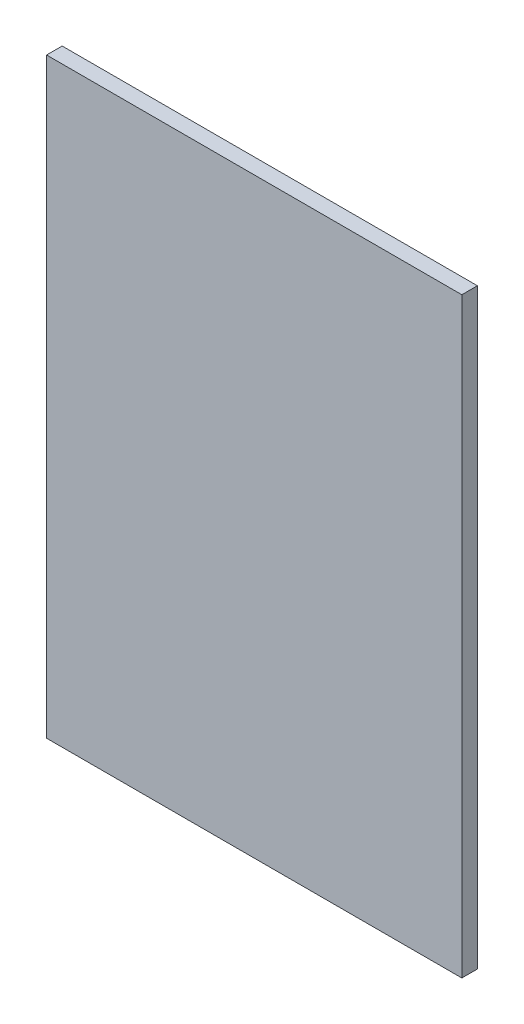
from build123d import *

# Parameters (mm, degrees)
CROQUIS1_W              = 400
CROQUIS1_H              = 570
SALIENTE_EXTRUIR1_DEPTH = 15


with BuildPart() as part:
    # Croquis1 → Saliente-Extruir1 (new body)
    with BuildSketch(Plane.XY):
        Rectangle(CROQUIS1_W, CROQUIS1_H)
    extrude(amount=SALIENTE_EXTRUIR1_DEPTH)


solid = part.part
